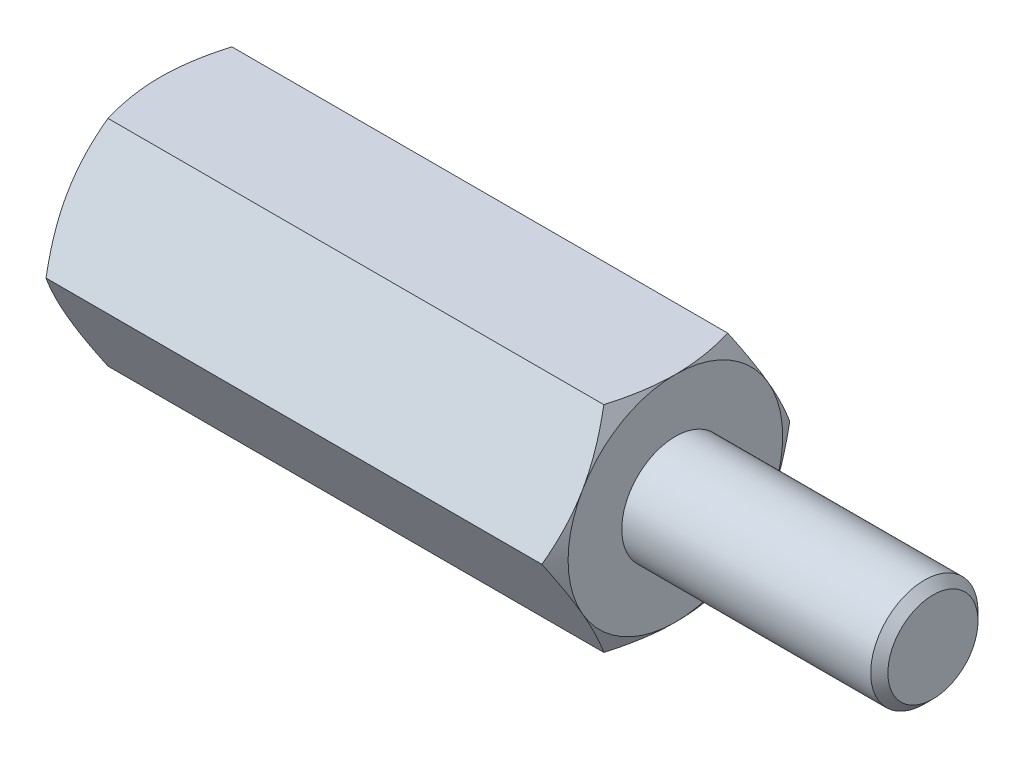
from build123d import *

# Parameters (mm, degrees)
EXTRUDE2_DEPTH = 6
SKETCH3_R      = 1.05
EXTRUDE3_DEPTH = 6
SKETCH5_R      = 1.25
EXTRUDE4_DEPTH = 6
CHAMFER1_SIZE  = 0.2


with BuildPart() as part:
    # Sketch1 → Extrude2 (new, symmetric)
    with BuildSketch(Plane(origin=(0, 0, 0), x_dir=(0, 0, -1), z_dir=(1, 0, 0))):
        Polygon((1.443375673, 2.5), (-1.443375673, 2.5), (-2.886751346, 0), (-1.443375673, -2.5), (1.443375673, -2.5), (2.886751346, 0), align=None)
    extrude(amount=EXTRUDE2_DEPTH, both=True)

    # Sketch2 → Cut-Revolve1 (revolve, cut)
    with BuildSketch(Plane.XY):
        with BuildLine():
            Line((-6, 2.5), (-4.5, 5.098076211))
            ThreePointArc((-4.5, 5.098076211), (-4.98810136, 6.276457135), (-6, 5.5))
            Line((-6, 5.5), (-6, 2.5))
        make_face()
    cut_revolve1 = revolve(axis=Axis((0, 0, 0), (1, 0, 0)), mode=Mode.SUBTRACT)

    # Mirror1: Cut-Revolve1 across plane
    add(cut_revolve1.mirror(Plane(origin=(0, 0, 0), x_dir=(0, 0, 1), z_dir=(1, 0, 0))), mode=Mode.SUBTRACT)

    # Sketch3 → Extrude3 (cut)
    with BuildSketch(Plane.ZY.offset(6)):
        Circle(SKETCH3_R)
    extrude(amount=-EXTRUDE3_DEPTH, mode=Mode.SUBTRACT)

    # Sketch4 → Cut-Revolve2 (revolve, cut)
    with BuildSketch(Plane.XY, mode=Mode.PRIVATE) as cut_revolve2_sk:
        Polygon((0, 0), (0, 1.05), (0.606217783, 0), align=None)
    revolve(cut_revolve2_sk.sketch.rotate(Axis((0.606217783, 0, 0), (-1, 0, 0)), 180), axis=Axis((0.606217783, 0, 0), (-1, 0, 0)), mode=Mode.SUBTRACT)

    # Sketch5 → Extrude4 (add)
    with BuildSketch(Plane(origin=(6, 0, 0), x_dir=(0, 0, -1), z_dir=(1, 0, 0))):
        Circle(SKETCH5_R)
    extrude(amount=EXTRUDE4_DEPTH)

    # Chamfer1
    chamfer1_edges = [part.edges().sort_by_distance(p)[0] for p in [
        (12, 0, 1.25),
    ]]
    chamfer(chamfer1_edges, length=CHAMFER1_SIZE)


solid = part.part
